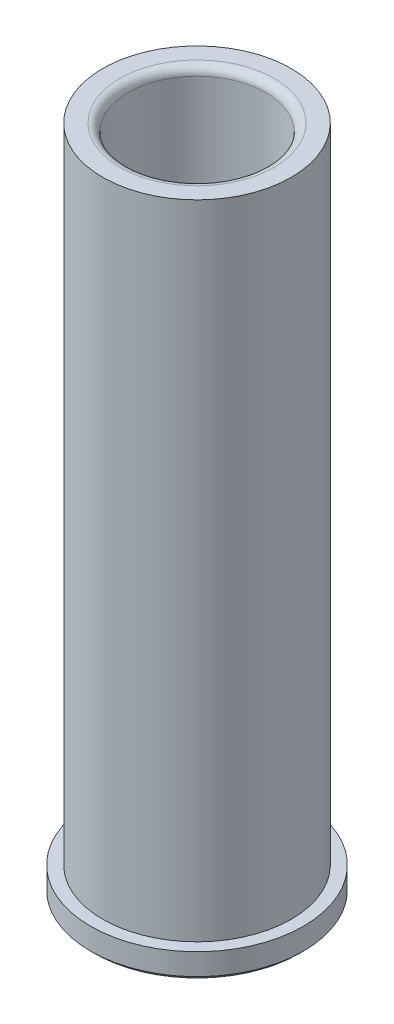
ISO-10303-21;
HEADER;
FILE_DESCRIPTION(('STEP AP214'),'2;1');
FILE_NAME('part.step','',(''),(''),'','','');
FILE_SCHEMA(('AUTOMOTIVE_DESIGN { 1 0 10303 214 1 1 1 1 }'));
ENDSEC;
DATA;
#1=APPLICATION_CONTEXT('core data for automotive mechanical design processes');
#2=APPLICATION_PROTOCOL_DEFINITION('international standard','automotive_design',2000,#1);
#3=PRODUCT_CONTEXT('',#1,'mechanical');
#4=PRODUCT('Part','Part','',(#3));
#5=PRODUCT_RELATED_PRODUCT_CATEGORY('part','',(#4));
#6=PRODUCT_DEFINITION_FORMATION('','',#4);
#7=PRODUCT_DEFINITION_CONTEXT('part definition',#1,'design');
#8=PRODUCT_DEFINITION('design','',#6,#7);
#9=PRODUCT_DEFINITION_SHAPE('','',#8);
#10=(LENGTH_UNIT() NAMED_UNIT(*) SI_UNIT(.MILLI.,.METRE.));
#11=(NAMED_UNIT(*) PLANE_ANGLE_UNIT() SI_UNIT($,.RADIAN.));
#12=(NAMED_UNIT(*) SI_UNIT($,.STERADIAN.) SOLID_ANGLE_UNIT());
#13=UNCERTAINTY_MEASURE_WITH_UNIT(LENGTH_MEASURE(1.E-05),#10,'distance_accuracy_value','');
#14=(GEOMETRIC_REPRESENTATION_CONTEXT(3) GLOBAL_UNCERTAINTY_ASSIGNED_CONTEXT((#13)) GLOBAL_UNIT_ASSIGNED_CONTEXT((#10,
#11,#12)) REPRESENTATION_CONTEXT('',''));
#15=CARTESIAN_POINT('',(0.,0.,0.));
#16=DIRECTION('',(0.,0.,1.));
#17=DIRECTION('',(1.,0.,0.));
#18=AXIS2_PLACEMENT_3D('',#15,#16,#17);
#19=CARTESIAN_POINT('',(3.49148336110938E-12,-1000.,0.));
#20=DIRECTION('',(0.,-1.,0.));
#21=DIRECTION('',(1.,0.,0.));
#22=AXIS2_PLACEMENT_3D('',#19,#20,#21);
#23=CYLINDRICAL_SURFACE('',#22,17.4688499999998);
#24=CARTESIAN_POINT('',(0.,4.7625,0.));
#25=DIRECTION('',(0.,-1.,0.));
#26=DIRECTION('',(1.,0.,0.));
#27=AXIS2_PLACEMENT_3D('',#24,#25,#26);
#28=CIRCLE('',#27,17.46885);
#29=CARTESIAN_POINT('',(17.4688499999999,4.76250000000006,0.));
#30=VERTEX_POINT('',#29);
#31=EDGE_CURVE('E60',#30,#30,#28,.T.);
#32=ORIENTED_EDGE('',*,*,#31,.F.);
#33=EDGE_LOOP('',(#32));
#34=FACE_BOUND('',#33,.T.);
#35=CARTESIAN_POINT('',(-4.3233292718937E-13,123.825,0.));
#36=DIRECTION('',(0.,-1.,0.));
#37=DIRECTION('',(1.,0.,0.));
#38=AXIS2_PLACEMENT_3D('',#35,#36,#37);
#39=CIRCLE('',#38,17.4688499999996);
#40=CARTESIAN_POINT('',(17.4688499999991,123.825,0.));
#41=VERTEX_POINT('',#40);
#42=EDGE_CURVE('E39',#41,#41,#39,.T.);
#43=ORIENTED_EDGE('',*,*,#42,.T.);
#44=EDGE_LOOP('',(#43));
#45=FACE_BOUND('',#44,.T.);
#46=ADVANCED_FACE('F28',(#34,#45),#23,.T.);
#47=CARTESIAN_POINT('',(-17.46885,123.825,0.));
#48=DIRECTION('',(0.,-1.,0.));
#49=DIRECTION('',(1.,0.,0.));
#50=AXIS2_PLACEMENT_3D('',#47,#48,#49);
#51=PLANE('',#50);
#52=CARTESIAN_POINT('',(-4.32332927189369E-13,123.825,0.));
#53=DIRECTION('',(0.,-1.,0.));
#54=DIRECTION('',(1.,0.,0.));
#55=AXIS2_PLACEMENT_3D('',#52,#53,#54);
#56=CIRCLE('',#55,14.2874999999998);
#57=CARTESIAN_POINT('',(14.2874999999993,123.825,0.));
#58=VERTEX_POINT('',#57);
#59=EDGE_CURVE('E35',#58,#58,#56,.T.);
#60=ORIENTED_EDGE('',*,*,#59,.T.);
#61=EDGE_LOOP('',(#60));
#62=FACE_BOUND('',#61,.T.);
#63=ORIENTED_EDGE('',*,*,#42,.F.);
#64=EDGE_LOOP('',(#63));
#65=FACE_BOUND('',#64,.T.);
#66=ADVANCED_FACE('F68',(#62,#65),#51,.F.);
#67=CARTESIAN_POINT('',(3.49148336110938E-12,-1000.,0.));
#68=DIRECTION('',(0.,-1.,0.));
#69=DIRECTION('',(1.,0.,0.));
#70=AXIS2_PLACEMENT_3D('',#67,#68,#69);
#71=CYLINDRICAL_SURFACE('',#70,12.7634999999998);
#72=CARTESIAN_POINT('',(-4.27011906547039E-13,122.301,0.));
#73=DIRECTION('',(0.,-1.,0.));
#74=DIRECTION('',(1.,0.,0.));
#75=AXIS2_PLACEMENT_3D('',#72,#73,#74);
#76=CIRCLE('',#75,12.7634999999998);
#77=CARTESIAN_POINT('',(12.7634999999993,122.301,0.));
#78=VERTEX_POINT('',#77);
#79=EDGE_CURVE('E10',#78,#78,#76,.F.);
#80=ORIENTED_EDGE('',*,*,#79,.T.);
#81=EDGE_LOOP('',(#80));
#82=FACE_BOUND('',#81,.T.);
#83=CARTESIAN_POINT('',(0.,0.761999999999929,0.));
#84=DIRECTION('',(0.,-1.,0.));
#85=DIRECTION('',(1.,0.,0.));
#86=AXIS2_PLACEMENT_3D('',#83,#84,#85);
#87=CIRCLE('',#86,12.7635);
#88=CARTESIAN_POINT('',(12.7635,0.761999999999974,0.));
#89=VERTEX_POINT('',#88);
#90=EDGE_CURVE('E43',#89,#89,#87,.T.);
#91=ORIENTED_EDGE('',*,*,#90,.T.);
#92=EDGE_LOOP('',(#91));
#93=FACE_BOUND('',#92,.T.);
#94=ADVANCED_FACE('F72',(#82,#93),#71,.F.);
#95=CARTESIAN_POINT('',(0.,0.,0.));
#96=DIRECTION('',(0.,-1.,0.));
#97=DIRECTION('',(1.,0.,0.));
#98=AXIS2_PLACEMENT_3D('',#95,#96,#97);
#99=CONICAL_SURFACE('',#98,13.5255,0.785398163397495);
#100=ORIENTED_EDGE('',*,*,#90,.F.);
#101=EDGE_LOOP('',(#100));
#102=FACE_BOUND('',#101,.T.);
#103=CARTESIAN_POINT('',(0.,0.,0.));
#104=DIRECTION('',(0.,-1.,0.));
#105=DIRECTION('',(1.,0.,0.));
#106=AXIS2_PLACEMENT_3D('',#103,#104,#105);
#107=CIRCLE('',#106,13.5255);
#108=CARTESIAN_POINT('',(13.5255,0.,0.));
#109=VERTEX_POINT('',#108);
#110=EDGE_CURVE('E48',#109,#109,#107,.T.);
#111=ORIENTED_EDGE('',*,*,#110,.T.);
#112=EDGE_LOOP('',(#111));
#113=FACE_BOUND('',#112,.T.);
#114=ADVANCED_FACE('F77',(#102,#113),#99,.F.);
#115=CARTESIAN_POINT('',(-13.5255,0.,0.));
#116=DIRECTION('',(0.,1.,0.));
#117=DIRECTION('',(-1.,0.,0.));
#118=AXIS2_PLACEMENT_3D('',#115,#116,#117);
#119=PLANE('',#118);
#120=ORIENTED_EDGE('',*,*,#110,.F.);
#121=EDGE_LOOP('',(#120));
#122=FACE_BOUND('',#121,.T.);
#123=CARTESIAN_POINT('',(0.,0.,0.));
#124=DIRECTION('',(0.,-1.,0.));
#125=DIRECTION('',(1.,0.,0.));
#126=AXIS2_PLACEMENT_3D('',#123,#124,#125);
#127=CIRCLE('',#126,18.9484);
#128=CARTESIAN_POINT('',(18.9484,0.,0.));
#129=VERTEX_POINT('',#128);
#130=EDGE_CURVE('E51',#129,#129,#127,.T.);
#131=ORIENTED_EDGE('',*,*,#130,.T.);
#132=EDGE_LOOP('',(#131));
#133=FACE_BOUND('',#132,.T.);
#134=ADVANCED_FACE('F82',(#122,#133),#119,.F.);
#135=CARTESIAN_POINT('',(0.,0.761999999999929,0.));
#136=DIRECTION('',(0.,1.,0.));
#137=DIRECTION('',(-1.,0.,0.));
#138=AXIS2_PLACEMENT_3D('',#135,#136,#137);
#139=CONICAL_SURFACE('',#138,19.7104,0.785398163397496);
#140=ORIENTED_EDGE('',*,*,#130,.F.);
#141=EDGE_LOOP('',(#140));
#142=FACE_BOUND('',#141,.T.);
#143=CARTESIAN_POINT('',(0.,0.761999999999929,0.));
#144=DIRECTION('',(0.,-1.,0.));
#145=DIRECTION('',(1.,0.,0.));
#146=AXIS2_PLACEMENT_3D('',#143,#144,#145);
#147=CIRCLE('',#146,19.7104);
#148=CARTESIAN_POINT('',(19.7104,0.761999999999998,0.));
#149=VERTEX_POINT('',#148);
#150=EDGE_CURVE('E54',#149,#149,#147,.T.);
#151=ORIENTED_EDGE('',*,*,#150,.T.);
#152=EDGE_LOOP('',(#151));
#153=FACE_BOUND('',#152,.T.);
#154=ADVANCED_FACE('F86',(#142,#153),#139,.T.);
#155=CARTESIAN_POINT('',(3.49148336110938E-12,-1000.,0.));
#156=DIRECTION('',(0.,-1.,0.));
#157=DIRECTION('',(1.,0.,0.));
#158=AXIS2_PLACEMENT_3D('',#155,#156,#157);
#159=CYLINDRICAL_SURFACE('',#158,19.7104);
#160=ORIENTED_EDGE('',*,*,#150,.F.);
#161=EDGE_LOOP('',(#160));
#162=FACE_BOUND('',#161,.T.);
#163=CARTESIAN_POINT('',(0.,4.7625,0.));
#164=DIRECTION('',(0.,-1.,0.));
#165=DIRECTION('',(1.,0.,0.));
#166=AXIS2_PLACEMENT_3D('',#163,#164,#165);
#167=CIRCLE('',#166,19.7104);
#168=CARTESIAN_POINT('',(19.7104,4.76250000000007,0.));
#169=VERTEX_POINT('',#168);
#170=EDGE_CURVE('E57',#169,#169,#167,.T.);
#171=ORIENTED_EDGE('',*,*,#170,.T.);
#172=EDGE_LOOP('',(#171));
#173=FACE_BOUND('',#172,.T.);
#174=ADVANCED_FACE('F90',(#162,#173),#159,.T.);
#175=CARTESIAN_POINT('',(-19.7104,4.76249999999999,0.));
#176=DIRECTION('',(0.,-1.,0.));
#177=DIRECTION('',(1.,0.,0.));
#178=AXIS2_PLACEMENT_3D('',#175,#176,#177);
#179=PLANE('',#178);
#180=ORIENTED_EDGE('',*,*,#170,.F.);
#181=EDGE_LOOP('',(#180));
#182=FACE_BOUND('',#181,.T.);
#183=ORIENTED_EDGE('',*,*,#31,.T.);
#184=EDGE_LOOP('',(#183));
#185=FACE_BOUND('',#184,.T.);
#186=ADVANCED_FACE('F64',(#182,#185),#179,.F.);
#187=CARTESIAN_POINT('',(-4.27011906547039E-13,122.301,0.));
#188=DIRECTION('',(0.,-1.,0.));
#189=DIRECTION('',(1.,0.,0.));
#190=AXIS2_PLACEMENT_3D('',#187,#188,#189);
#191=TOROIDAL_SURFACE('',#190,14.2874999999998,1.524);
#192=ORIENTED_EDGE('',*,*,#79,.F.);
#193=EDGE_LOOP('',(#192));
#194=FACE_BOUND('',#193,.T.);
#195=ORIENTED_EDGE('',*,*,#59,.F.);
#196=EDGE_LOOP('',(#195));
#197=FACE_BOUND('',#196,.T.);
#198=ADVANCED_FACE('F30',(#194,#197),#191,.T.);
#199=CLOSED_SHELL('',(#46,#66,#94,#114,#134,#154,#174,#186,#198));
#200=MANIFOLD_SOLID_BREP('B2',#199);
#201=ADVANCED_BREP_SHAPE_REPRESENTATION('',(#18,#200),#14);
#202=SHAPE_DEFINITION_REPRESENTATION(#9,#201);
ENDSEC;
END-ISO-10303-21;
